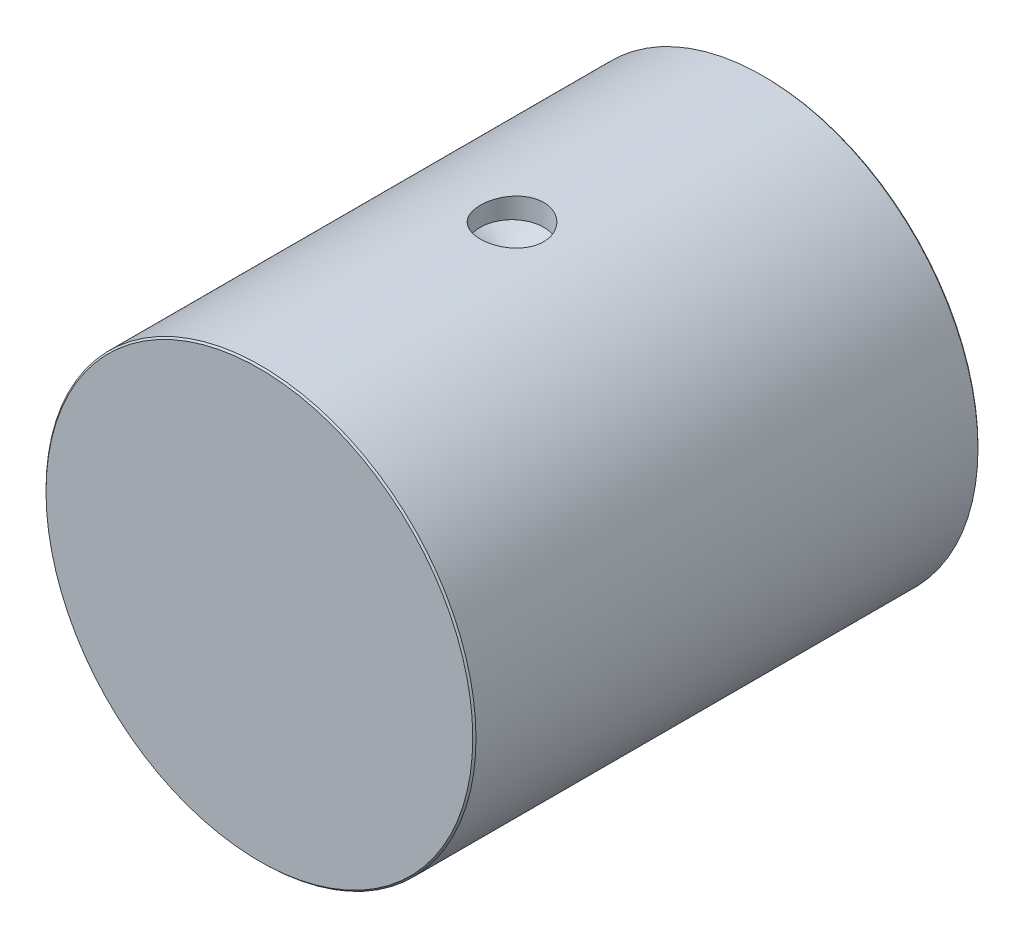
from build123d import *

# Parameters (mm, degrees)
BASE_EXTRUSION_DEPTH      = 23.5
BASE_EXTRUSION_DEPTH_BACK = 23.5
ESQUISSE1_R               = 20
CHANFREIN1_SIZE           = 0.15


with BuildPart() as part:
    # Esquisse1 → Base-Extrusion (new, two sides: drawn at the far end of the back side and taken through both)
    with BuildSketch(Plane.XY.offset(-BASE_EXTRUSION_DEPTH_BACK)):
        Circle(ESQUISSE1_R)
    extrude(amount=BASE_EXTRUSION_DEPTH + BASE_EXTRUSION_DEPTH_BACK)

    # Chanfrein1
    chanfrein1_edges = [part.edges().sort_by_distance(p)[0] for p in [
        (-20, 0, 23.5),
        (-20, 0, -23.5),
    ]]
    chamfer(chanfrein1_edges, length=CHANFREIN1_SIZE)

    # Esquisse2 → Enl_vement de mati_re-R_volution1 (revolve, cut)
    with BuildSketch(Plane(origin=(0, 0, 0), x_dir=(0, 0, -1), z_dir=(1, 0, 0))):
        Polygon((2.95, 20), (0, 20), (0, 16.296816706), (2.95, 18), align=None)
    revolve(axis=Axis((0, -1.790561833, 0), (0, 1, 0)), mode=Mode.SUBTRACT)


solid = part.part
